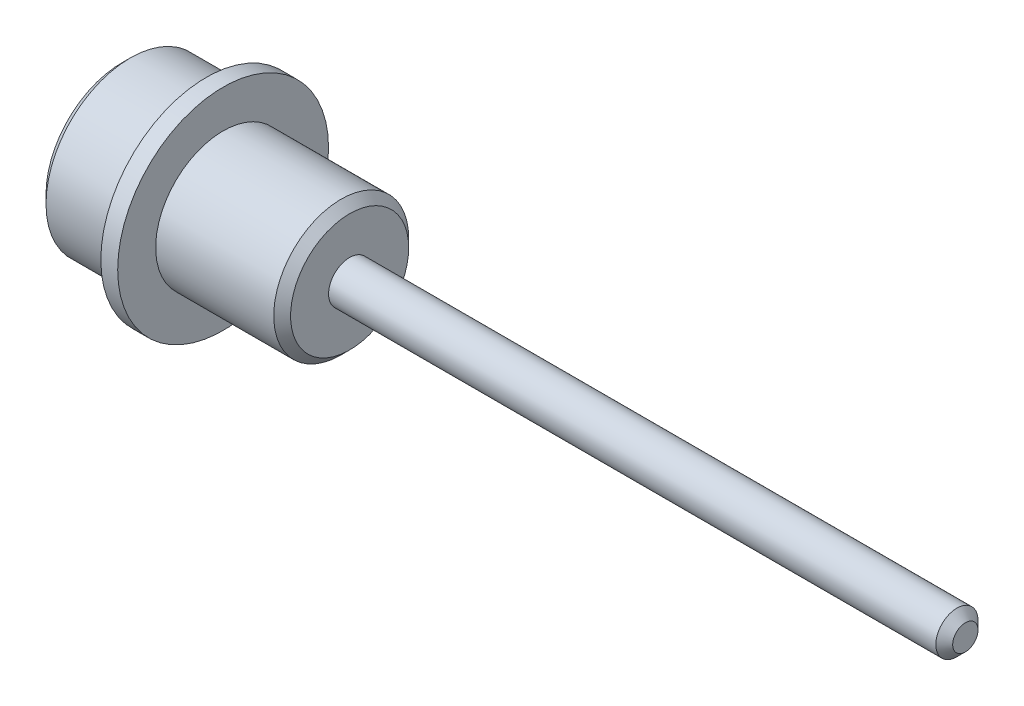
ISO-10303-21;
HEADER;
FILE_DESCRIPTION(('STEP AP214'),'2;1');
FILE_NAME('part.step','',(''),(''),'','','');
FILE_SCHEMA(('AUTOMOTIVE_DESIGN { 1 0 10303 214 1 1 1 1 }'));
ENDSEC;
DATA;
#1=APPLICATION_CONTEXT('core data for automotive mechanical design processes');
#2=APPLICATION_PROTOCOL_DEFINITION('international standard','automotive_design',2000,#1);
#3=PRODUCT_CONTEXT('',#1,'mechanical');
#4=PRODUCT('Part','Part','',(#3));
#5=PRODUCT_RELATED_PRODUCT_CATEGORY('part','',(#4));
#6=PRODUCT_DEFINITION_FORMATION('','',#4);
#7=PRODUCT_DEFINITION_CONTEXT('part definition',#1,'design');
#8=PRODUCT_DEFINITION('design','',#6,#7);
#9=PRODUCT_DEFINITION_SHAPE('','',#8);
#10=(LENGTH_UNIT() NAMED_UNIT(*) SI_UNIT(.MILLI.,.METRE.));
#11=(NAMED_UNIT(*) PLANE_ANGLE_UNIT() SI_UNIT($,.RADIAN.));
#12=(NAMED_UNIT(*) SI_UNIT($,.STERADIAN.) SOLID_ANGLE_UNIT());
#13=UNCERTAINTY_MEASURE_WITH_UNIT(LENGTH_MEASURE(1.E-05),#10,'distance_accuracy_value','');
#14=(GEOMETRIC_REPRESENTATION_CONTEXT(3) GLOBAL_UNCERTAINTY_ASSIGNED_CONTEXT((#13)) GLOBAL_UNIT_ASSIGNED_CONTEXT((#10,
#11,#12)) REPRESENTATION_CONTEXT('',''));
#15=CARTESIAN_POINT('',(0.,0.,0.));
#16=DIRECTION('',(0.,0.,1.));
#17=DIRECTION('',(1.,0.,0.));
#18=AXIS2_PLACEMENT_3D('',#15,#16,#17);
#19=CARTESIAN_POINT('',(0.,0.,0.));
#20=DIRECTION('',(-1.,0.,0.));
#21=DIRECTION('',(0.,0.,1.));
#22=AXIS2_PLACEMENT_3D('',#19,#20,#21);
#23=PLANE('',#22);
#24=CARTESIAN_POINT('',(0.,0.,0.));
#25=DIRECTION('',(-1.,0.,0.));
#26=DIRECTION('',(0.,0.,1.));
#27=AXIS2_PLACEMENT_3D('',#24,#25,#26);
#28=CIRCLE('',#27,8.99999999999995);
#29=CARTESIAN_POINT('',(0.,0.,8.99999999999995));
#30=VERTEX_POINT('',#29);
#31=EDGE_CURVE('E50',#30,#30,#28,.T.);
#32=ORIENTED_EDGE('',*,*,#31,.T.);
#33=EDGE_LOOP('',(#32));
#34=FACE_BOUND('',#33,.T.);
#35=ADVANCED_FACE('F30',(#34),#23,.T.);
#36=CARTESIAN_POINT('',(81.1761213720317,0.,0.));
#37=DIRECTION('',(1.,0.,0.));
#38=DIRECTION('',(0.,0.,-1.));
#39=AXIS2_PLACEMENT_3D('',#36,#37,#38);
#40=CYLINDRICAL_SURFACE('',#39,9.99999999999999);
#41=CARTESIAN_POINT('',(1.00000000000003,0.,0.));
#42=DIRECTION('',(-1.,0.,0.));
#43=DIRECTION('',(0.,0.,1.));
#44=AXIS2_PLACEMENT_3D('',#41,#42,#43);
#45=CIRCLE('',#44,9.99999999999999);
#46=CARTESIAN_POINT('',(1.00000000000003,0.,9.99999999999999));
#47=VERTEX_POINT('',#46);
#48=EDGE_CURVE('E53',#47,#47,#45,.F.);
#49=ORIENTED_EDGE('',*,*,#48,.T.);
#50=EDGE_LOOP('',(#49));
#51=FACE_BOUND('',#50,.T.);
#52=CARTESIAN_POINT('',(9.99999999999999,0.,0.));
#53=DIRECTION('',(1.,0.,0.));
#54=DIRECTION('',(0.,0.,-1.));
#55=AXIS2_PLACEMENT_3D('',#52,#53,#54);
#56=CIRCLE('',#55,9.99999999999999);
#57=CARTESIAN_POINT('',(9.99999999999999,0.,-9.99999999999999));
#58=VERTEX_POINT('',#57);
#59=EDGE_CURVE('E56',#58,#58,#56,.T.);
#60=ORIENTED_EDGE('',*,*,#59,.F.);
#61=EDGE_LOOP('',(#60));
#62=FACE_BOUND('',#61,.T.);
#63=ADVANCED_FACE('F88',(#51,#62),#40,.T.);
#64=CARTESIAN_POINT('',(10.,9.99999999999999,0.));
#65=DIRECTION('',(-1.,0.,0.));
#66=DIRECTION('',(0.,0.,1.));
#67=AXIS2_PLACEMENT_3D('',#64,#65,#66);
#68=PLANE('',#67);
#69=ORIENTED_EDGE('',*,*,#59,.T.);
#70=EDGE_LOOP('',(#69));
#71=FACE_BOUND('',#70,.T.);
#72=CARTESIAN_POINT('',(9.99999999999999,0.,0.));
#73=DIRECTION('',(1.,0.,0.));
#74=DIRECTION('',(0.,0.,-1.));
#75=AXIS2_PLACEMENT_3D('',#72,#73,#74);
#76=CIRCLE('',#75,12.5);
#77=CARTESIAN_POINT('',(9.99999999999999,0.,-12.5));
#78=VERTEX_POINT('',#77);
#79=EDGE_CURVE('E59',#78,#78,#76,.T.);
#80=ORIENTED_EDGE('',*,*,#79,.F.);
#81=EDGE_LOOP('',(#80));
#82=FACE_BOUND('',#81,.T.);
#83=ADVANCED_FACE('F94',(#71,#82),#68,.T.);
#84=CARTESIAN_POINT('',(81.1761213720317,0.,0.));
#85=DIRECTION('',(1.,0.,0.));
#86=DIRECTION('',(0.,0.,-1.));
#87=AXIS2_PLACEMENT_3D('',#84,#85,#86);
#88=CYLINDRICAL_SURFACE('',#87,12.5);
#89=ORIENTED_EDGE('',*,*,#79,.T.);
#90=EDGE_LOOP('',(#89));
#91=FACE_BOUND('',#90,.T.);
#92=CARTESIAN_POINT('',(12.,0.,0.));
#93=DIRECTION('',(1.,0.,0.));
#94=DIRECTION('',(0.,0.,-1.));
#95=AXIS2_PLACEMENT_3D('',#92,#93,#94);
#96=CIRCLE('',#95,12.5);
#97=CARTESIAN_POINT('',(12.,0.,-12.5));
#98=VERTEX_POINT('',#97);
#99=EDGE_CURVE('E62',#98,#98,#96,.T.);
#100=ORIENTED_EDGE('',*,*,#99,.F.);
#101=EDGE_LOOP('',(#100));
#102=FACE_BOUND('',#101,.T.);
#103=ADVANCED_FACE('F159',(#91,#102),#88,.T.);
#104=CARTESIAN_POINT('',(12.,12.5,0.));
#105=DIRECTION('',(1.,0.,0.));
#106=DIRECTION('',(0.,0.,-1.));
#107=AXIS2_PLACEMENT_3D('',#104,#105,#106);
#108=PLANE('',#107);
#109=ORIENTED_EDGE('',*,*,#99,.T.);
#110=EDGE_LOOP('',(#109));
#111=FACE_BOUND('',#110,.T.);
#112=CARTESIAN_POINT('',(12.,0.,0.));
#113=DIRECTION('',(1.,0.,0.));
#114=DIRECTION('',(0.,0.,-1.));
#115=AXIS2_PLACEMENT_3D('',#112,#113,#114);
#116=CIRCLE('',#115,7.99999999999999);
#117=CARTESIAN_POINT('',(12.,0.,-7.99999999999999));
#118=VERTEX_POINT('',#117);
#119=EDGE_CURVE('E65',#118,#118,#116,.T.);
#120=ORIENTED_EDGE('',*,*,#119,.F.);
#121=EDGE_LOOP('',(#120));
#122=FACE_BOUND('',#121,.T.);
#123=ADVANCED_FACE('F85',(#111,#122),#108,.T.);
#124=CARTESIAN_POINT('',(81.1761213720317,0.,0.));
#125=DIRECTION('',(1.,0.,0.));
#126=DIRECTION('',(0.,0.,-1.));
#127=AXIS2_PLACEMENT_3D('',#124,#125,#126);
#128=CYLINDRICAL_SURFACE('',#127,7.99999999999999);
#129=CARTESIAN_POINT('',(26.,0.,0.));
#130=DIRECTION('',(1.,0.,0.));
#131=DIRECTION('',(0.,0.,-1.));
#132=AXIS2_PLACEMENT_3D('',#129,#130,#131);
#133=CIRCLE('',#132,7.99999999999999);
#134=CARTESIAN_POINT('',(26.,0.,-7.99999999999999));
#135=VERTEX_POINT('',#134);
#136=EDGE_CURVE('E10',#135,#135,#133,.F.);
#137=ORIENTED_EDGE('',*,*,#136,.T.);
#138=EDGE_LOOP('',(#137));
#139=FACE_BOUND('',#138,.T.);
#140=ORIENTED_EDGE('',*,*,#119,.T.);
#141=EDGE_LOOP('',(#140));
#142=FACE_BOUND('',#141,.T.);
#143=ADVANCED_FACE('F76',(#139,#142),#128,.T.);
#144=CARTESIAN_POINT('',(27.,7.99999999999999,0.));
#145=DIRECTION('',(1.,0.,0.));
#146=DIRECTION('',(0.,0.,-1.));
#147=AXIS2_PLACEMENT_3D('',#144,#145,#146);
#148=PLANE('',#147);
#149=CARTESIAN_POINT('',(27.,0.,0.));
#150=DIRECTION('',(1.,0.,0.));
#151=DIRECTION('',(0.,0.,-1.));
#152=AXIS2_PLACEMENT_3D('',#149,#150,#151);
#153=CIRCLE('',#152,6.99999999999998);
#154=CARTESIAN_POINT('',(27.,0.,-6.99999999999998));
#155=VERTEX_POINT('',#154);
#156=EDGE_CURVE('E37',#155,#155,#153,.T.);
#157=ORIENTED_EDGE('',*,*,#156,.T.);
#158=EDGE_LOOP('',(#157));
#159=FACE_BOUND('',#158,.T.);
#160=CARTESIAN_POINT('',(27.,0.,0.));
#161=DIRECTION('',(1.,0.,0.));
#162=DIRECTION('',(0.,0.,-1.));
#163=AXIS2_PLACEMENT_3D('',#160,#161,#162);
#164=CIRCLE('',#163,2.49999999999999);
#165=CARTESIAN_POINT('',(27.,0.,-2.49999999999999));
#166=VERTEX_POINT('',#165);
#167=EDGE_CURVE('E68',#166,#166,#164,.T.);
#168=ORIENTED_EDGE('',*,*,#167,.F.);
#169=EDGE_LOOP('',(#168));
#170=FACE_BOUND('',#169,.T.);
#171=ADVANCED_FACE('F74',(#159,#170),#148,.T.);
#172=CARTESIAN_POINT('',(81.1761213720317,0.,0.));
#173=DIRECTION('',(1.,0.,0.));
#174=DIRECTION('',(0.,0.,-1.));
#175=AXIS2_PLACEMENT_3D('',#172,#173,#174);
#176=CYLINDRICAL_SURFACE('',#175,2.49999999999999);
#177=CARTESIAN_POINT('',(99.,0.,0.));
#178=DIRECTION('',(1.,0.,0.));
#179=DIRECTION('',(0.,0.,-1.));
#180=AXIS2_PLACEMENT_3D('',#177,#178,#179);
#181=CIRCLE('',#180,2.49999999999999);
#182=CARTESIAN_POINT('',(99.,0.,-2.49999999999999));
#183=VERTEX_POINT('',#182);
#184=EDGE_CURVE('E41',#183,#183,#181,.F.);
#185=ORIENTED_EDGE('',*,*,#184,.T.);
#186=EDGE_LOOP('',(#185));
#187=FACE_BOUND('',#186,.T.);
#188=ORIENTED_EDGE('',*,*,#167,.T.);
#189=EDGE_LOOP('',(#188));
#190=FACE_BOUND('',#189,.T.);
#191=ADVANCED_FACE('F72',(#187,#190),#176,.T.);
#192=CARTESIAN_POINT('',(100.,2.49999999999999,0.));
#193=DIRECTION('',(1.,0.,0.));
#194=DIRECTION('',(0.,0.,-1.));
#195=AXIS2_PLACEMENT_3D('',#192,#193,#194);
#196=PLANE('',#195);
#197=CARTESIAN_POINT('',(100.,0.,0.));
#198=DIRECTION('',(1.,0.,0.));
#199=DIRECTION('',(0.,0.,-1.));
#200=AXIS2_PLACEMENT_3D('',#197,#198,#199);
#201=CIRCLE('',#200,1.49999999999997);
#202=CARTESIAN_POINT('',(100.,0.,-1.49999999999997));
#203=VERTEX_POINT('',#202);
#204=EDGE_CURVE('E45',#203,#203,#201,.T.);
#205=ORIENTED_EDGE('',*,*,#204,.T.);
#206=EDGE_LOOP('',(#205));
#207=FACE_BOUND('',#206,.T.);
#208=ADVANCED_FACE('F82',(#207),#196,.T.);
#209=CARTESIAN_POINT('',(1.00000000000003,0.,0.));
#210=DIRECTION('',(1.,0.,0.));
#211=DIRECTION('',(0.,0.,-1.));
#212=AXIS2_PLACEMENT_3D('',#209,#210,#211);
#213=CONICAL_SURFACE('',#212,9.99999999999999,0.785398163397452);
#214=ORIENTED_EDGE('',*,*,#31,.F.);
#215=EDGE_LOOP('',(#214));
#216=FACE_BOUND('',#215,.T.);
#217=ORIENTED_EDGE('',*,*,#48,.F.);
#218=EDGE_LOOP('',(#217));
#219=FACE_BOUND('',#218,.T.);
#220=ADVANCED_FACE('F99',(#216,#219),#213,.T.);
#221=CARTESIAN_POINT('',(100.,0.,0.));
#222=DIRECTION('',(-1.,0.,0.));
#223=DIRECTION('',(0.,0.,1.));
#224=AXIS2_PLACEMENT_3D('',#221,#222,#223);
#225=CONICAL_SURFACE('',#224,1.49999999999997,0.785398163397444);
#226=ORIENTED_EDGE('',*,*,#184,.F.);
#227=EDGE_LOOP('',(#226));
#228=FACE_BOUND('',#227,.T.);
#229=ORIENTED_EDGE('',*,*,#204,.F.);
#230=EDGE_LOOP('',(#229));
#231=FACE_BOUND('',#230,.T.);
#232=ADVANCED_FACE('F101',(#228,#231),#225,.T.);
#233=CARTESIAN_POINT('',(27.,0.,0.));
#234=DIRECTION('',(-1.,0.,0.));
#235=DIRECTION('',(0.,0.,1.));
#236=AXIS2_PLACEMENT_3D('',#233,#234,#235);
#237=CONICAL_SURFACE('',#236,6.99999999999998,0.78539816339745);
#238=ORIENTED_EDGE('',*,*,#136,.F.);
#239=EDGE_LOOP('',(#238));
#240=FACE_BOUND('',#239,.T.);
#241=ORIENTED_EDGE('',*,*,#156,.F.);
#242=EDGE_LOOP('',(#241));
#243=FACE_BOUND('',#242,.T.);
#244=ADVANCED_FACE('F32',(#240,#243),#237,.T.);
#245=CLOSED_SHELL('',(#35,#63,#83,#103,#123,#143,#171,#191,#208,#220,#232,#244));
#246=MANIFOLD_SOLID_BREP('B2',#245);
#247=ADVANCED_BREP_SHAPE_REPRESENTATION('',(#18,#246),#14);
#248=SHAPE_DEFINITION_REPRESENTATION(#9,#247);
ENDSEC;
END-ISO-10303-21;
